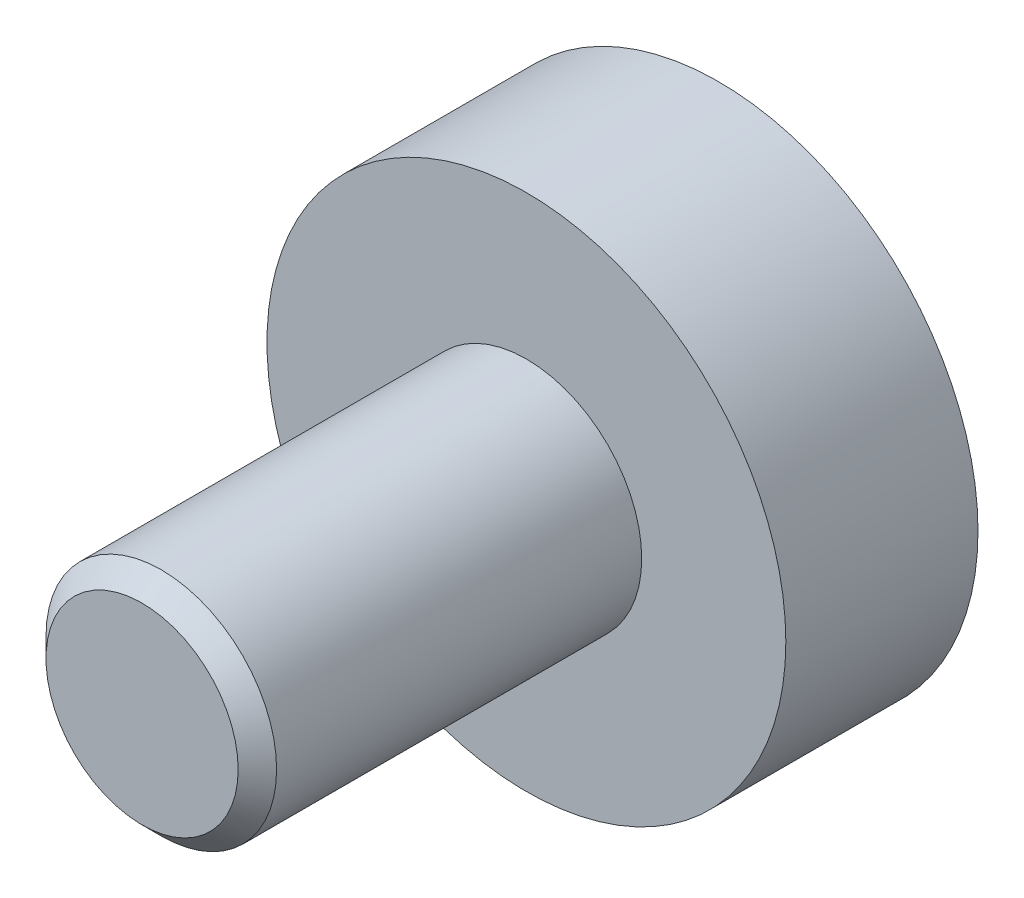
from build123d import *

# Parameters (mm, degrees)
ESQUISSE1_R      = 13.5
EXTRUSION1_DEPTH = 10
ESQUISSE2_R      = 6
EXTRUSION2_DEPTH = 20
CHANFREIN1_SIZE  = 1


with BuildPart() as part:
    # Esquisse1 → Extrusion1 (new body)
    with BuildSketch(Plane.XY):
        Circle(ESQUISSE1_R)
    extrude(amount=EXTRUSION1_DEPTH)

    # Esquisse2 → Extrusion2 (add)
    with BuildSketch(Plane.XY.offset(10)):
        Circle(ESQUISSE2_R)
    extrude(amount=EXTRUSION2_DEPTH)

    # Chanfrein1
    chanfrein1_edges = [part.edges().sort_by_distance(p)[0] for p in [
        (-6, 0, 30),
    ]]
    chamfer(chanfrein1_edges, length=CHANFREIN1_SIZE)

    # Esquisse3 → Enl_vement de mati_re-R_volution1 (revolve, cut)
    with BuildSketch(Plane(origin=(0, 0, 0), x_dir=(1, 0, 0), z_dir=(0, 1, 0))):
        with BuildLine():
            Line((0, -3.209143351), (0, 56.790856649))
            ThreePointArc((0, 56.790856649), (-30, 26.790856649), (0, -3.209143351))
        make_face()
    revolve(axis=Axis((0, 0, -57.984488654), (0, 0, 1)), mode=Mode.SUBTRACT)


solid = part.part
